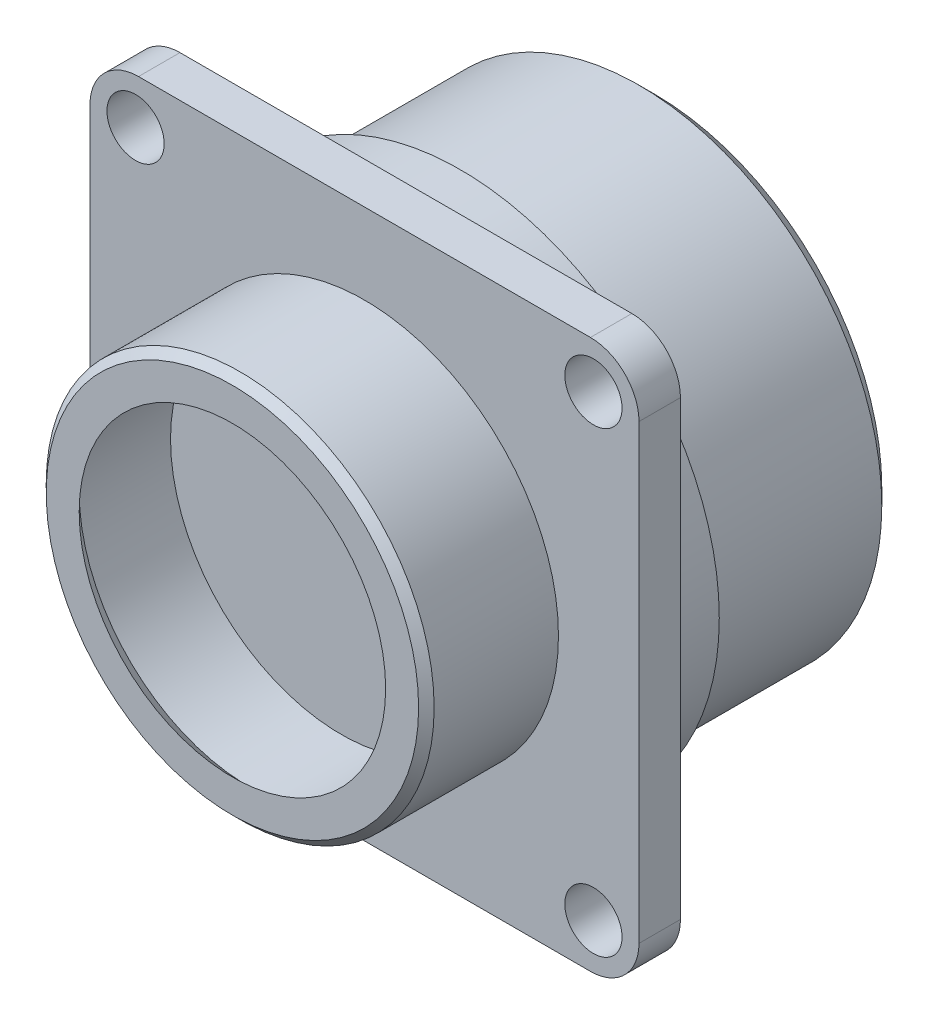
ISO-10303-21;
HEADER;
FILE_DESCRIPTION(('STEP AP214'),'2;1');
FILE_NAME('part.step','',(''),(''),'','','');
FILE_SCHEMA(('AUTOMOTIVE_DESIGN { 1 0 10303 214 1 1 1 1 }'));
ENDSEC;
DATA;
#1=APPLICATION_CONTEXT('core data for automotive mechanical design processes');
#2=APPLICATION_PROTOCOL_DEFINITION('international standard','automotive_design',2000,#1);
#3=PRODUCT_CONTEXT('',#1,'mechanical');
#4=PRODUCT('Part','Part','',(#3));
#5=PRODUCT_RELATED_PRODUCT_CATEGORY('part','',(#4));
#6=PRODUCT_DEFINITION_FORMATION('','',#4);
#7=PRODUCT_DEFINITION_CONTEXT('part definition',#1,'design');
#8=PRODUCT_DEFINITION('design','',#6,#7);
#9=PRODUCT_DEFINITION_SHAPE('','',#8);
#10=(LENGTH_UNIT() NAMED_UNIT(*) SI_UNIT(.MILLI.,.METRE.));
#11=(NAMED_UNIT(*) PLANE_ANGLE_UNIT() SI_UNIT($,.RADIAN.));
#12=(NAMED_UNIT(*) SI_UNIT($,.STERADIAN.) SOLID_ANGLE_UNIT());
#13=UNCERTAINTY_MEASURE_WITH_UNIT(LENGTH_MEASURE(1.E-05),#10,'distance_accuracy_value','');
#14=(GEOMETRIC_REPRESENTATION_CONTEXT(3) GLOBAL_UNCERTAINTY_ASSIGNED_CONTEXT((#13)) GLOBAL_UNIT_ASSIGNED_CONTEXT((#10,
#11,#12)) REPRESENTATION_CONTEXT('',''));
#15=CARTESIAN_POINT('',(0.,0.,0.));
#16=DIRECTION('',(0.,0.,1.));
#17=DIRECTION('',(1.,0.,0.));
#18=AXIS2_PLACEMENT_3D('',#15,#16,#17);
#19=CARTESIAN_POINT('',(0.,0.,22.352));
#20=DIRECTION('',(0.,0.,-1.));
#21=DIRECTION('',(-1.,0.,0.));
#22=AXIS2_PLACEMENT_3D('',#19,#20,#21);
#23=CYLINDRICAL_SURFACE('',#22,19.0246);
#24=CARTESIAN_POINT('',(0.,0.,21.59));
#25=DIRECTION('',(0.,0.,1.));
#26=DIRECTION('',(1.,0.,0.));
#27=AXIS2_PLACEMENT_3D('',#24,#25,#26);
#28=CIRCLE('',#27,19.0246);
#29=CARTESIAN_POINT('',(19.0246,0.,21.59));
#30=VERTEX_POINT('',#29);
#31=EDGE_CURVE('E11',#30,#30,#28,.F.);
#32=ORIENTED_EDGE('',*,*,#31,.T.);
#33=EDGE_LOOP('',(#32));
#34=FACE_BOUND('',#33,.T.);
#35=CARTESIAN_POINT('',(0.,0.,9.398));
#36=DIRECTION('',(0.,0.,1.));
#37=DIRECTION('',(1.,0.,0.));
#38=AXIS2_PLACEMENT_3D('',#35,#36,#37);
#39=CIRCLE('',#38,19.0246);
#40=CARTESIAN_POINT('',(19.0246,0.,9.398));
#41=VERTEX_POINT('',#40);
#42=EDGE_CURVE('E391',#41,#41,#39,.T.);
#43=ORIENTED_EDGE('',*,*,#42,.T.);
#44=EDGE_LOOP('',(#43));
#45=FACE_BOUND('',#44,.T.);
#46=ADVANCED_FACE('F381',(#34,#45),#23,.T.);
#47=CARTESIAN_POINT('',(0.,0.,22.352));
#48=DIRECTION('',(0.,0.,1.));
#49=DIRECTION('',(1.,0.,0.));
#50=AXIS2_PLACEMENT_3D('',#47,#48,#49);
#51=PLANE('',#50);
#52=CARTESIAN_POINT('',(0.,0.,22.352));
#53=DIRECTION('',(0.,0.,1.));
#54=DIRECTION('',(1.,0.,0.));
#55=AXIS2_PLACEMENT_3D('',#52,#53,#54);
#56=CIRCLE('',#55,15.0297077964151);
#57=CARTESIAN_POINT('',(15.0297077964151,0.,22.352));
#58=VERTEX_POINT('',#57);
#59=EDGE_CURVE('E398',#58,#58,#56,.T.);
#60=ORIENTED_EDGE('',*,*,#59,.F.);
#61=EDGE_LOOP('',(#60));
#62=FACE_BOUND('',#61,.T.);
#63=CARTESIAN_POINT('',(0.,0.,22.352));
#64=DIRECTION('',(0.,0.,1.));
#65=DIRECTION('',(1.,0.,0.));
#66=AXIS2_PLACEMENT_3D('',#63,#64,#65);
#67=CIRCLE('',#66,18.2626);
#68=CARTESIAN_POINT('',(18.2626,0.,22.352));
#69=VERTEX_POINT('',#68);
#70=EDGE_CURVE('E387',#69,#69,#67,.T.);
#71=ORIENTED_EDGE('',*,*,#70,.T.);
#72=EDGE_LOOP('',(#71));
#73=FACE_BOUND('',#72,.T.);
#74=ADVANCED_FACE('F425',(#62,#73),#51,.T.);
#75=CARTESIAN_POINT('',(0.,0.,9.398));
#76=DIRECTION('',(0.,0.,1.));
#77=DIRECTION('',(1.,0.,0.));
#78=AXIS2_PLACEMENT_3D('',#75,#76,#77);
#79=PLANE('',#78);
#80=ORIENTED_EDGE('',*,*,#42,.F.);
#81=EDGE_LOOP('',(#80));
#82=FACE_BOUND('',#81,.T.);
#83=ADVANCED_FACE('F431',(#82),#79,.F.);
#84=CARTESIAN_POINT('',(0.,0.,22.352));
#85=DIRECTION('',(0.,0.,-1.));
#86=DIRECTION('',(-1.,0.,0.));
#87=AXIS2_PLACEMENT_3D('',#84,#85,#86);
#88=CONICAL_SURFACE('',#87,18.2626,0.785398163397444);
#89=ORIENTED_EDGE('',*,*,#31,.F.);
#90=EDGE_LOOP('',(#89));
#91=FACE_BOUND('',#90,.T.);
#92=ORIENTED_EDGE('',*,*,#70,.F.);
#93=EDGE_LOOP('',(#92));
#94=FACE_BOUND('',#93,.T.);
#95=ADVANCED_FACE('F414',(#91,#94),#88,.T.);
#96=CARTESIAN_POINT('',(0.,0.,22.352));
#97=DIRECTION('',(0.,0.,-1.));
#98=DIRECTION('',(-1.,0.,0.));
#99=AXIS2_PLACEMENT_3D('',#96,#97,#98);
#100=CYLINDRICAL_SURFACE('',#99,16.7386);
#101=CARTESIAN_POINT('',(0.,0.,20.6431077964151));
#102=DIRECTION('',(0.,0.,-1.));
#103=DIRECTION('',(-1.,0.,0.));
#104=AXIS2_PLACEMENT_3D('',#101,#102,#103);
#105=CIRCLE('',#104,16.7386);
#106=CARTESIAN_POINT('',(-16.7386,0.,20.6431077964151));
#107=VERTEX_POINT('',#106);
#108=EDGE_CURVE('E395',#107,#107,#105,.T.);
#109=ORIENTED_EDGE('',*,*,#108,.F.);
#110=EDGE_LOOP('',(#109));
#111=FACE_BOUND('',#110,.T.);
#112=CARTESIAN_POINT('',(0.,0.,11.684));
#113=DIRECTION('',(0.,0.,1.));
#114=DIRECTION('',(1.,0.,0.));
#115=AXIS2_PLACEMENT_3D('',#112,#113,#114);
#116=CIRCLE('',#115,16.7386);
#117=CARTESIAN_POINT('',(16.7386,0.,11.684));
#118=VERTEX_POINT('',#117);
#119=EDGE_CURVE('E401',#118,#118,#116,.T.);
#120=ORIENTED_EDGE('',*,*,#119,.F.);
#121=EDGE_LOOP('',(#120));
#122=FACE_BOUND('',#121,.T.);
#123=ADVANCED_FACE('F410',(#111,#122),#100,.F.);
#124=CARTESIAN_POINT('',(0.,0.,11.684));
#125=DIRECTION('',(0.,0.,1.));
#126=DIRECTION('',(1.,0.,0.));
#127=AXIS2_PLACEMENT_3D('',#124,#125,#126);
#128=PLANE('',#127);
#129=ORIENTED_EDGE('',*,*,#119,.T.);
#130=EDGE_LOOP('',(#129));
#131=FACE_BOUND('',#130,.T.);
#132=ADVANCED_FACE('F413',(#131),#128,.T.);
#133=CARTESIAN_POINT('',(0.,0.,20.7355538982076));
#134=DIRECTION('',(0.,0.,-1.));
#135=DIRECTION('',(-1.,0.,0.));
#136=AXIS2_PLACEMENT_3D('',#133,#134,#135);
#137=CONICAL_SURFACE('',#136,16.6461538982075,0.785398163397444);
#138=ORIENTED_EDGE('',*,*,#108,.T.);
#139=EDGE_LOOP('',(#138));
#140=FACE_BOUND('',#139,.T.);
#141=ORIENTED_EDGE('',*,*,#59,.T.);
#142=EDGE_LOOP('',(#141));
#143=FACE_BOUND('',#142,.T.);
#144=ADVANCED_FACE('F407',(#140,#143),#137,.F.);
#145=CLOSED_SHELL('',(#46,#74,#83,#95,#123,#132,#144));
#146=MANIFOLD_SOLID_BREP('B2',#145);
#147=CARTESIAN_POINT('',(0.,0.,-19.05));
#148=DIRECTION('',(0.,0.,1.));
#149=DIRECTION('',(1.,0.,0.));
#150=AXIS2_PLACEMENT_3D('',#147,#148,#149);
#151=CYLINDRICAL_SURFACE('',#150,23.8125);
#152=CARTESIAN_POINT('',(0.,0.,-17.526));
#153=DIRECTION('',(0.,0.,-1.));
#154=DIRECTION('',(-1.,0.,0.));
#155=AXIS2_PLACEMENT_3D('',#152,#153,#154);
#156=CIRCLE('',#155,23.8125);
#157=CARTESIAN_POINT('',(23.8125,0.,-17.526));
#158=VERTEX_POINT('',#157);
#159=EDGE_CURVE('E380',#158,#158,#156,.F.);
#160=CARTESIAN_POINT('',(0.,0.,0.));
#161=DIRECTION('',(0.,0.,-1.));
#162=DIRECTION('',(-1.,0.,0.));
#163=AXIS2_PLACEMENT_3D('',#160,#161,#162);
#164=CIRCLE('',#163,23.8125);
#165=CARTESIAN_POINT('',(23.8125,0.,0.));
#166=VERTEX_POINT('',#165);
#167=EDGE_CURVE('E486',#166,#166,#164,.T.);
#168=CARTESIAN_POINT('',(23.8125,0.,-17.526));
#169=CARTESIAN_POINT('',(23.8125,0.,-17.3434375));
#170=CARTESIAN_POINT('',(23.8125,0.,-17.160875));
#171=CARTESIAN_POINT('',(23.8125,0.,-16.79575));
#172=CARTESIAN_POINT('',(23.8125,0.,-16.6131875));
#173=CARTESIAN_POINT('',(23.8125,0.,-16.2480625));
#174=CARTESIAN_POINT('',(23.8125,0.,-16.0655));
#175=CARTESIAN_POINT('',(23.8125,0.,-15.700375));
#176=CARTESIAN_POINT('',(23.8125,0.,-15.5178125));
#177=CARTESIAN_POINT('',(23.8125,0.,-15.1526875));
#178=CARTESIAN_POINT('',(23.8125,0.,-14.970125));
#179=CARTESIAN_POINT('',(23.8125,0.,-14.605));
#180=CARTESIAN_POINT('',(23.8125,0.,-14.4224375));
#181=CARTESIAN_POINT('',(23.8125,0.,-14.0573125));
#182=CARTESIAN_POINT('',(23.8125,0.,-13.87475));
#183=CARTESIAN_POINT('',(23.8125,0.,-13.509625));
#184=CARTESIAN_POINT('',(23.8125,0.,-13.3270625));
#185=CARTESIAN_POINT('',(23.8125,0.,-12.9619375));
#186=CARTESIAN_POINT('',(23.8125,0.,-12.779375));
#187=CARTESIAN_POINT('',(23.8125,0.,-12.41425));
#188=CARTESIAN_POINT('',(23.8125,0.,-12.2316875));
#189=CARTESIAN_POINT('',(23.8125,0.,-11.8665625));
#190=CARTESIAN_POINT('',(23.8125,0.,-11.684));
#191=CARTESIAN_POINT('',(23.8125,0.,-11.318875));
#192=CARTESIAN_POINT('',(23.8125,0.,-11.1363125));
#193=CARTESIAN_POINT('',(23.8125,0.,-10.7711875));
#194=CARTESIAN_POINT('',(23.8125,0.,-10.588625));
#195=CARTESIAN_POINT('',(23.8125,0.,-10.2235));
#196=CARTESIAN_POINT('',(23.8125,0.,-10.0409375));
#197=CARTESIAN_POINT('',(23.8125,0.,-9.6758125));
#198=CARTESIAN_POINT('',(23.8125,0.,-9.49325));
#199=CARTESIAN_POINT('',(23.8125,0.,-9.128125));
#200=CARTESIAN_POINT('',(23.8125,0.,-8.9455625));
#201=CARTESIAN_POINT('',(23.8125,0.,-8.5804375));
#202=CARTESIAN_POINT('',(23.8125,0.,-8.397875));
#203=CARTESIAN_POINT('',(23.8125,0.,-8.03275));
#204=CARTESIAN_POINT('',(23.8125,0.,-7.8501875));
#205=CARTESIAN_POINT('',(23.8125,0.,-7.4850625));
#206=CARTESIAN_POINT('',(23.8125,0.,-7.3025));
#207=CARTESIAN_POINT('',(23.8125,0.,-6.937375));
#208=CARTESIAN_POINT('',(23.8125,0.,-6.7548125));
#209=CARTESIAN_POINT('',(23.8125,0.,-6.3896875));
#210=CARTESIAN_POINT('',(23.8125,0.,-6.207125));
#211=CARTESIAN_POINT('',(23.8125,0.,-5.842));
#212=CARTESIAN_POINT('',(23.8125,0.,-5.6594375));
#213=CARTESIAN_POINT('',(23.8125,0.,-5.2943125));
#214=CARTESIAN_POINT('',(23.8125,0.,-5.11175));
#215=CARTESIAN_POINT('',(23.8125,0.,-4.746625));
#216=CARTESIAN_POINT('',(23.8125,0.,-4.5640625));
#217=CARTESIAN_POINT('',(23.8125,0.,-4.1989375));
#218=CARTESIAN_POINT('',(23.8125,0.,-4.016375));
#219=CARTESIAN_POINT('',(23.8125,0.,-3.65125));
#220=CARTESIAN_POINT('',(23.8125,0.,-3.4686875));
#221=CARTESIAN_POINT('',(23.8125,0.,-3.1035625));
#222=CARTESIAN_POINT('',(23.8125,0.,-2.921));
#223=CARTESIAN_POINT('',(23.8125,0.,-2.555875));
#224=CARTESIAN_POINT('',(23.8125,0.,-2.3733125));
#225=CARTESIAN_POINT('',(23.8125,0.,-2.0081875));
#226=CARTESIAN_POINT('',(23.8125,0.,-1.825625));
#227=CARTESIAN_POINT('',(23.8125,0.,-1.4605));
#228=CARTESIAN_POINT('',(23.8125,0.,-1.2779375));
#229=CARTESIAN_POINT('',(23.8125,0.,-0.912812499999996));
#230=CARTESIAN_POINT('',(23.8125,0.,-0.730249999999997));
#231=CARTESIAN_POINT('',(23.8125,0.,-0.365124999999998));
#232=CARTESIAN_POINT('',(23.8125,0.,-0.182562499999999));
#233=CARTESIAN_POINT('',(23.8125,0.,0.));
#234=B_SPLINE_CURVE_WITH_KNOTS('',3,(#168,#169,#170,#171,#172,#173,#174,#175,#176,#177,#178,
#179,#180,#181,#182,#183,#184,#185,#186,#187,#188,#189,#190,#191,#192,#193,#194,#195,#196,#197,
#198,#199,#200,#201,#202,#203,#204,#205,#206,#207,#208,#209,#210,#211,#212,#213,#214,#215,#216,
#217,#218,#219,#220,#221,#222,#223,#224,#225,#226,#227,#228,#229,#230,#231,#232,#233),
.UNSPECIFIED.,.F.,.F.,(4,2,2,2,2,2,2,2,2,2,2,2,2,2,2,2,2,2,2,2,2,2,2,2,2,2,2,2,2,2,2,2,4),(0.,
0.547687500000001,1.095375,1.6430625,2.19075,2.7384375,3.286125,3.8338125,4.3815,4.9291875,
5.476875,6.0245625,6.57225,7.1199375,7.667625,8.2153125,8.763,9.3106875,9.858375,10.4060625,
10.95375,11.5014375,12.049125,12.5968125,13.1445,13.6921875,14.239875,14.7875625,15.33525,
15.8829375,16.430625,16.9783125,17.526),.UNSPECIFIED.);
#235=EDGE_CURVE('BSEAM476',#158,#166,#234,.T.);
#236=ORIENTED_EDGE('',*,*,#159,.T.);
#237=ORIENTED_EDGE('',*,*,#167,.T.);
#238=ORIENTED_EDGE('',*,*,#235,.T.);
#239=ORIENTED_EDGE('',*,*,#235,.F.);
#240=EDGE_LOOP('',(#236,#238,#237,#239));
#241=FACE_BOUND('',#240,.T.);
#242=ADVANCED_FACE('F476',(#241),#151,.T.);
#243=CARTESIAN_POINT('',(0.,0.,-19.05));
#244=DIRECTION('',(0.,0.,-1.));
#245=DIRECTION('',(-1.,0.,0.));
#246=AXIS2_PLACEMENT_3D('',#243,#244,#245);
#247=PLANE('',#246);
#248=CARTESIAN_POINT('',(0.,0.,-19.05));
#249=DIRECTION('',(0.,0.,-1.));
#250=DIRECTION('',(-1.,0.,0.));
#251=AXIS2_PLACEMENT_3D('',#248,#249,#250);
#252=CIRCLE('',#251,22.2885);
#253=CARTESIAN_POINT('',(-22.2885,0.,-19.05));
#254=VERTEX_POINT('',#253);
#255=EDGE_CURVE('E482',#254,#254,#252,.T.);
#256=ORIENTED_EDGE('',*,*,#255,.T.);
#257=EDGE_LOOP('',(#256));
#258=FACE_BOUND('',#257,.T.);
#259=CARTESIAN_POINT('',(0.,0.,-19.05));
#260=DIRECTION('',(0.,0.,-1.));
#261=DIRECTION('',(-1.,0.,0.));
#262=AXIS2_PLACEMENT_3D('',#259,#260,#261);
#263=CIRCLE('',#262,21.2725);
#264=CARTESIAN_POINT('',(21.2725,0.,-19.05));
#265=VERTEX_POINT('',#264);
#266=EDGE_CURVE('E490',#265,#265,#263,.T.);
#267=ORIENTED_EDGE('',*,*,#266,.F.);
#268=EDGE_LOOP('',(#267));
#269=FACE_BOUND('',#268,.T.);
#270=ADVANCED_FACE('F512',(#258,#269),#247,.T.);
#271=CARTESIAN_POINT('',(0.,0.,0.));
#272=DIRECTION('',(0.,0.,-1.));
#273=DIRECTION('',(-1.,0.,0.));
#274=AXIS2_PLACEMENT_3D('',#271,#272,#273);
#275=PLANE('',#274);
#276=ORIENTED_EDGE('',*,*,#167,.F.);
#277=EDGE_LOOP('',(#276));
#278=FACE_BOUND('',#277,.T.);
#279=ADVANCED_FACE('F503',(#278),#275,.F.);
#280=CARTESIAN_POINT('',(0.,0.,-19.05));
#281=DIRECTION('',(0.,0.,1.));
#282=DIRECTION('',(1.,0.,0.));
#283=AXIS2_PLACEMENT_3D('',#280,#281,#282);
#284=CYLINDRICAL_SURFACE('',#283,21.2725);
#285=CARTESIAN_POINT('',(0.,0.,-2.54));
#286=DIRECTION('',(0.,0.,-1.));
#287=DIRECTION('',(-1.,0.,0.));
#288=AXIS2_PLACEMENT_3D('',#285,#286,#287);
#289=CIRCLE('',#288,21.2725);
#290=CARTESIAN_POINT('',(21.2725,0.,-2.54));
#291=VERTEX_POINT('',#290);
#292=EDGE_CURVE('E495',#291,#291,#289,.T.);
#293=CARTESIAN_POINT('',(21.2725,0.,-19.05));
#294=CARTESIAN_POINT('',(21.2725,0.,-18.8780208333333));
#295=CARTESIAN_POINT('',(21.2725,0.,-18.7060416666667));
#296=CARTESIAN_POINT('',(21.2725,0.,-18.3620833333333));
#297=CARTESIAN_POINT('',(21.2725,0.,-18.1901041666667));
#298=CARTESIAN_POINT('',(21.2725,0.,-17.8461458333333));
#299=CARTESIAN_POINT('',(21.2725,0.,-17.6741666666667));
#300=CARTESIAN_POINT('',(21.2725,0.,-17.3302083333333));
#301=CARTESIAN_POINT('',(21.2725,0.,-17.1582291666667));
#302=CARTESIAN_POINT('',(21.2725,0.,-16.8142708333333));
#303=CARTESIAN_POINT('',(21.2725,0.,-16.6422916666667));
#304=CARTESIAN_POINT('',(21.2725,0.,-16.2983333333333));
#305=CARTESIAN_POINT('',(21.2725,0.,-16.1263541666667));
#306=CARTESIAN_POINT('',(21.2725,0.,-15.7823958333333));
#307=CARTESIAN_POINT('',(21.2725,0.,-15.6104166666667));
#308=CARTESIAN_POINT('',(21.2725,0.,-15.2664583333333));
#309=CARTESIAN_POINT('',(21.2725,0.,-15.0944791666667));
#310=CARTESIAN_POINT('',(21.2725,0.,-14.7505208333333));
#311=CARTESIAN_POINT('',(21.2725,0.,-14.5785416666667));
#312=CARTESIAN_POINT('',(21.2725,0.,-14.2345833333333));
#313=CARTESIAN_POINT('',(21.2725,0.,-14.0626041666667));
#314=CARTESIAN_POINT('',(21.2725,0.,-13.7186458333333));
#315=CARTESIAN_POINT('',(21.2725,0.,-13.5466666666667));
#316=CARTESIAN_POINT('',(21.2725,0.,-13.2027083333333));
#317=CARTESIAN_POINT('',(21.2725,0.,-13.0307291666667));
#318=CARTESIAN_POINT('',(21.2725,0.,-12.6867708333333));
#319=CARTESIAN_POINT('',(21.2725,0.,-12.5147916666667));
#320=CARTESIAN_POINT('',(21.2725,0.,-12.1708333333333));
#321=CARTESIAN_POINT('',(21.2725,0.,-11.9988541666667));
#322=CARTESIAN_POINT('',(21.2725,0.,-11.6548958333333));
#323=CARTESIAN_POINT('',(21.2725,0.,-11.4829166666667));
#324=CARTESIAN_POINT('',(21.2725,0.,-11.1389583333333));
#325=CARTESIAN_POINT('',(21.2725,0.,-10.9669791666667));
#326=CARTESIAN_POINT('',(21.2725,0.,-10.6230208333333));
#327=CARTESIAN_POINT('',(21.2725,0.,-10.4510416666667));
#328=CARTESIAN_POINT('',(21.2725,0.,-10.1070833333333));
#329=CARTESIAN_POINT('',(21.2725,0.,-9.93510416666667));
#330=CARTESIAN_POINT('',(21.2725,0.,-9.59114583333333));
#331=CARTESIAN_POINT('',(21.2725,0.,-9.41916666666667));
#332=CARTESIAN_POINT('',(21.2725,0.,-9.07520833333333));
#333=CARTESIAN_POINT('',(21.2725,0.,-8.90322916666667));
#334=CARTESIAN_POINT('',(21.2725,0.,-8.55927083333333));
#335=CARTESIAN_POINT('',(21.2725,0.,-8.38729166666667));
#336=CARTESIAN_POINT('',(21.2725,0.,-8.04333333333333));
#337=CARTESIAN_POINT('',(21.2725,0.,-7.87135416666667));
#338=CARTESIAN_POINT('',(21.2725,0.,-7.52739583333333));
#339=CARTESIAN_POINT('',(21.2725,0.,-7.35541666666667));
#340=CARTESIAN_POINT('',(21.2725,0.,-7.01145833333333));
#341=CARTESIAN_POINT('',(21.2725,0.,-6.83947916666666));
#342=CARTESIAN_POINT('',(21.2725,0.,-6.49552083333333));
#343=CARTESIAN_POINT('',(21.2725,0.,-6.32354166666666));
#344=CARTESIAN_POINT('',(21.2725,0.,-5.97958333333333));
#345=CARTESIAN_POINT('',(21.2725,0.,-5.80760416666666));
#346=CARTESIAN_POINT('',(21.2725,0.,-5.46364583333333));
#347=CARTESIAN_POINT('',(21.2725,0.,-5.29166666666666));
#348=CARTESIAN_POINT('',(21.2725,0.,-4.94770833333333));
#349=CARTESIAN_POINT('',(21.2725,0.,-4.77572916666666));
#350=CARTESIAN_POINT('',(21.2725,0.,-4.43177083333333));
#351=CARTESIAN_POINT('',(21.2725,0.,-4.25979166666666));
#352=CARTESIAN_POINT('',(21.2725,0.,-3.91583333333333));
#353=CARTESIAN_POINT('',(21.2725,0.,-3.74385416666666));
#354=CARTESIAN_POINT('',(21.2725,0.,-3.39989583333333));
#355=CARTESIAN_POINT('',(21.2725,0.,-3.22791666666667));
#356=CARTESIAN_POINT('',(21.2725,0.,-2.88395833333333));
#357=CARTESIAN_POINT('',(21.2725,0.,-2.71197916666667));
#358=CARTESIAN_POINT('',(21.2725,0.,-2.54));
#359=B_SPLINE_CURVE_WITH_KNOTS('',3,(#293,#294,#295,#296,#297,#298,#299,#300,#301,#302,#303,
#304,#305,#306,#307,#308,#309,#310,#311,#312,#313,#314,#315,#316,#317,#318,#319,#320,#321,#322,
#323,#324,#325,#326,#327,#328,#329,#330,#331,#332,#333,#334,#335,#336,#337,#338,#339,#340,#341,
#342,#343,#344,#345,#346,#347,#348,#349,#350,#351,#352,#353,#354,#355,#356,#357,#358),
.UNSPECIFIED.,.F.,.F.,(4,2,2,2,2,2,2,2,2,2,2,2,2,2,2,2,2,2,2,2,2,2,2,2,2,2,2,2,2,2,2,2,4),(0.,
0.515937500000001,1.031875,1.5478125,2.06375,2.5796875,3.095625,3.6115625,4.1275,4.6434375,
5.159375,5.6753125,6.19125,6.7071875,7.223125,7.7390625,8.255,8.7709375,9.286875,9.8028125,
10.31875,10.8346875,11.350625,11.8665625,12.3825,12.8984375,13.414375,13.9303125,14.44625,
14.9621875,15.478125,15.9940625,16.51),.UNSPECIFIED.);
#360=EDGE_CURVE('BSEAM501',#265,#291,#359,.T.);
#361=ORIENTED_EDGE('',*,*,#266,.T.);
#362=ORIENTED_EDGE('',*,*,#292,.F.);
#363=ORIENTED_EDGE('',*,*,#360,.T.);
#364=ORIENTED_EDGE('',*,*,#360,.F.);
#365=EDGE_LOOP('',(#361,#363,#362,#364));
#366=FACE_BOUND('',#365,.T.);
#367=ADVANCED_FACE('F501',(#366),#284,.F.);
#368=CARTESIAN_POINT('',(0.,0.,-2.54));
#369=DIRECTION('',(0.,0.,-1.));
#370=DIRECTION('',(-1.,0.,0.));
#371=AXIS2_PLACEMENT_3D('',#368,#369,#370);
#372=PLANE('',#371);
#373=ORIENTED_EDGE('',*,*,#292,.T.);
#374=EDGE_LOOP('',(#373));
#375=FACE_BOUND('',#374,.T.);
#376=ADVANCED_FACE('F499',(#375),#372,.T.);
#377=CARTESIAN_POINT('',(0.,0.,-19.05));
#378=DIRECTION('',(0.,0.,1.));
#379=DIRECTION('',(1.,0.,0.));
#380=AXIS2_PLACEMENT_3D('',#377,#378,#379);
#381=CONICAL_SURFACE('',#380,22.2885,0.785398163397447);
#382=ORIENTED_EDGE('',*,*,#159,.F.);
#383=EDGE_LOOP('',(#382));
#384=FACE_BOUND('',#383,.T.);
#385=ORIENTED_EDGE('',*,*,#255,.F.);
#386=EDGE_LOOP('',(#385));
#387=FACE_BOUND('',#386,.T.);
#388=ADVANCED_FACE('F510',(#384,#387),#381,.T.);
#389=CLOSED_SHELL('',(#242,#270,#279,#367,#376,#388));
#390=MANIFOLD_SOLID_BREP('B6',#389);
#391=CARTESIAN_POINT('',(0.,0.,5.334));
#392=DIRECTION('',(0.,0.,-1.));
#393=DIRECTION('',(-1.,0.,0.));
#394=AXIS2_PLACEMENT_3D('',#391,#392,#393);
#395=CYLINDRICAL_SURFACE('',#394,25.4);
#396=CARTESIAN_POINT('',(0.,0.,5.334));
#397=DIRECTION('',(0.,0.,1.));
#398=DIRECTION('',(1.,0.,0.));
#399=AXIS2_PLACEMENT_3D('',#396,#397,#398);
#400=CIRCLE('',#399,25.4);
#401=CARTESIAN_POINT('',(25.4,0.,5.334));
#402=VERTEX_POINT('',#401);
#403=EDGE_CURVE('E664',#402,#402,#400,.T.);
#404=ORIENTED_EDGE('',*,*,#403,.F.);
#405=EDGE_LOOP('',(#404));
#406=FACE_BOUND('',#405,.T.);
#407=CARTESIAN_POINT('',(0.,0.,0.));
#408=DIRECTION('',(0.,0.,1.));
#409=DIRECTION('',(1.,0.,0.));
#410=AXIS2_PLACEMENT_3D('',#407,#408,#409);
#411=CIRCLE('',#410,25.4);
#412=CARTESIAN_POINT('',(25.4,0.,0.));
#413=VERTEX_POINT('',#412);
#414=EDGE_CURVE('E661',#413,#413,#411,.T.);
#415=ORIENTED_EDGE('',*,*,#414,.T.);
#416=EDGE_LOOP('',(#415));
#417=FACE_BOUND('',#416,.T.);
#418=ADVANCED_FACE('F550',(#406,#417),#395,.T.);
#419=CARTESIAN_POINT('',(0.,0.,0.));
#420=DIRECTION('',(0.,0.,1.));
#421=DIRECTION('',(1.,0.,0.));
#422=AXIS2_PLACEMENT_3D('',#419,#420,#421);
#423=PLANE('',#422);
#424=ORIENTED_EDGE('',*,*,#414,.F.);
#425=EDGE_LOOP('',(#424));
#426=FACE_BOUND('',#425,.T.);
#427=ADVANCED_FACE('F716',(#426),#423,.F.);
#428=CARTESIAN_POINT('',(-26.924,-26.924,5.334));
#429=DIRECTION('',(0.,0.,1.));
#430=DIRECTION('',(1.,0.,0.));
#431=AXIS2_PLACEMENT_3D('',#428,#429,#430);
#432=PLANE('',#431);
#433=CARTESIAN_POINT('',(22.4536,-22.4536,5.334));
#434=DIRECTION('',(0.,0.,1.));
#435=DIRECTION('',(1.,0.,0.));
#436=AXIS2_PLACEMENT_3D('',#433,#434,#435);
#437=CIRCLE('',#436,2.8067);
#438=CARTESIAN_POINT('',(25.2603,-22.4536,5.334));
#439=VERTEX_POINT('',#438);
#440=EDGE_CURVE('E813',#439,#439,#437,.T.);
#441=ORIENTED_EDGE('',*,*,#440,.T.);
#442=EDGE_LOOP('',(#441));
#443=FACE_BOUND('',#442,.T.);
#444=CARTESIAN_POINT('',(-22.4536,-22.4536,5.334));
#445=DIRECTION('',(0.,0.,1.));
#446=DIRECTION('',(1.,0.,0.));
#447=AXIS2_PLACEMENT_3D('',#444,#445,#446);
#448=CIRCLE('',#447,2.8067);
#449=CARTESIAN_POINT('',(-19.6469,-22.4536,5.334));
#450=VERTEX_POINT('',#449);
#451=EDGE_CURVE('E817',#450,#450,#448,.T.);
#452=ORIENTED_EDGE('',*,*,#451,.T.);
#453=EDGE_LOOP('',(#452));
#454=FACE_BOUND('',#453,.T.);
#455=CARTESIAN_POINT('',(22.4536,22.4536,5.334));
#456=DIRECTION('',(0.,0.,1.));
#457=DIRECTION('',(1.,0.,0.));
#458=AXIS2_PLACEMENT_3D('',#455,#456,#457);
#459=CIRCLE('',#458,2.8067);
#460=CARTESIAN_POINT('',(25.2603,22.4536,5.334));
#461=VERTEX_POINT('',#460);
#462=EDGE_CURVE('E826',#461,#461,#459,.T.);
#463=ORIENTED_EDGE('',*,*,#462,.T.);
#464=EDGE_LOOP('',(#463));
#465=FACE_BOUND('',#464,.T.);
#466=CARTESIAN_POINT('',(-22.4536,22.4536,5.334));
#467=DIRECTION('',(0.,0.,1.));
#468=DIRECTION('',(1.,0.,0.));
#469=AXIS2_PLACEMENT_3D('',#466,#467,#468);
#470=CIRCLE('',#469,2.8067);
#471=CARTESIAN_POINT('',(-19.6469,22.4536,5.334));
#472=VERTEX_POINT('',#471);
#473=EDGE_CURVE('E648',#472,#472,#470,.T.);
#474=ORIENTED_EDGE('',*,*,#473,.T.);
#475=EDGE_LOOP('',(#474));
#476=FACE_BOUND('',#475,.T.);
#477=DIRECTION('',(1.,0.,0.));
#478=VECTOR('',#477,1.);
#479=CARTESIAN_POINT('',(-26.924,-26.924,5.334));
#480=LINE('',#479,#478);
#481=CARTESIAN_POINT('',(-22.1615,-26.924,5.334));
#482=VERTEX_POINT('',#481);
#483=CARTESIAN_POINT('',(22.1615,-26.924,5.334));
#484=VERTEX_POINT('',#483);
#485=EDGE_CURVE('E632',#482,#484,#480,.T.);
#486=ORIENTED_EDGE('',*,*,#485,.F.);
#487=CARTESIAN_POINT('',(-22.1615,-22.1615,5.334));
#488=DIRECTION('',(0.,0.,1.));
#489=DIRECTION('',(1.,0.,0.));
#490=AXIS2_PLACEMENT_3D('',#487,#488,#489);
#491=CIRCLE('',#490,4.7625);
#492=CARTESIAN_POINT('',(-26.924,-22.1615,5.334));
#493=VERTEX_POINT('',#492);
#494=EDGE_CURVE('E615',#482,#493,#491,.F.);
#495=ORIENTED_EDGE('',*,*,#494,.T.);
#496=DIRECTION('',(0.,-1.,0.));
#497=VECTOR('',#496,1.);
#498=CARTESIAN_POINT('',(-26.924,26.924,5.334));
#499=LINE('',#498,#497);
#500=CARTESIAN_POINT('',(-26.924,22.1615,5.334));
#501=VERTEX_POINT('',#500);
#502=EDGE_CURVE('E643',#501,#493,#499,.T.);
#503=ORIENTED_EDGE('',*,*,#502,.F.);
#504=CARTESIAN_POINT('',(-22.1615,22.1615,5.334));
#505=DIRECTION('',(0.,0.,1.));
#506=DIRECTION('',(1.,0.,0.));
#507=AXIS2_PLACEMENT_3D('',#504,#505,#506);
#508=CIRCLE('',#507,4.7625);
#509=CARTESIAN_POINT('',(-22.1615,26.924,5.334));
#510=VERTEX_POINT('',#509);
#511=EDGE_CURVE('E636',#501,#510,#508,.F.);
#512=ORIENTED_EDGE('',*,*,#511,.T.);
#513=DIRECTION('',(-1.,0.,0.));
#514=VECTOR('',#513,1.);
#515=CARTESIAN_POINT('',(-26.924,26.924,5.334));
#516=LINE('',#515,#514);
#517=CARTESIAN_POINT('',(22.1615,26.924,5.334));
#518=VERTEX_POINT('',#517);
#519=EDGE_CURVE('E646',#518,#510,#516,.T.);
#520=ORIENTED_EDGE('',*,*,#519,.F.);
#521=CARTESIAN_POINT('',(22.1615,22.1615,5.334));
#522=DIRECTION('',(0.,0.,1.));
#523=DIRECTION('',(1.,0.,0.));
#524=AXIS2_PLACEMENT_3D('',#521,#522,#523);
#525=CIRCLE('',#524,4.7625);
#526=CARTESIAN_POINT('',(26.924,22.1615,5.334));
#527=VERTEX_POINT('',#526);
#528=EDGE_CURVE('E669',#518,#527,#525,.F.);
#529=ORIENTED_EDGE('',*,*,#528,.T.);
#530=DIRECTION('',(0.,1.,0.));
#531=VECTOR('',#530,1.);
#532=CARTESIAN_POINT('',(26.924,26.924,5.334));
#533=LINE('',#532,#531);
#534=CARTESIAN_POINT('',(26.924,-22.1615,5.334));
#535=VERTEX_POINT('',#534);
#536=EDGE_CURVE('E642',#535,#527,#533,.T.);
#537=ORIENTED_EDGE('',*,*,#536,.F.);
#538=CARTESIAN_POINT('',(22.1615,-22.1615,5.334));
#539=DIRECTION('',(0.,0.,1.));
#540=DIRECTION('',(1.,0.,0.));
#541=AXIS2_PLACEMENT_3D('',#538,#539,#540);
#542=CIRCLE('',#541,4.7625);
#543=EDGE_CURVE('E626',#535,#484,#542,.F.);
#544=ORIENTED_EDGE('',*,*,#543,.T.);
#545=EDGE_LOOP('',(#486,#495,#503,#512,#520,#529,#537,#544));
#546=FACE_BOUND('',#545,.T.);
#547=ORIENTED_EDGE('',*,*,#403,.T.);
#548=EDGE_LOOP('',(#547));
#549=FACE_BOUND('',#548,.T.);
#550=ADVANCED_FACE('F639',(#443,#454,#465,#476,#546,#549),#432,.F.);
#551=CARTESIAN_POINT('',(-26.924,26.924,9.398));
#552=DIRECTION('',(1.,0.,0.));
#553=DIRECTION('',(0.,1.,0.));
#554=AXIS2_PLACEMENT_3D('',#551,#552,#553);
#555=PLANE('',#554);
#556=ORIENTED_EDGE('',*,*,#502,.T.);
#557=DIRECTION('',(0.,0.,-1.));
#558=VECTOR('',#557,1.);
#559=CARTESIAN_POINT('',(-26.924,-22.1615,9.398));
#560=LINE('',#559,#558);
#561=CARTESIAN_POINT('',(-26.924,-22.1615,9.398));
#562=VERTEX_POINT('',#561);
#563=EDGE_CURVE('E620',#493,#562,#560,.F.);
#564=ORIENTED_EDGE('',*,*,#563,.T.);
#565=DIRECTION('',(0.,-1.,0.));
#566=VECTOR('',#565,1.);
#567=CARTESIAN_POINT('',(-26.924,26.924,9.398));
#568=LINE('',#567,#566);
#569=CARTESIAN_POINT('',(-26.924,22.1615,9.398));
#570=VERTEX_POINT('',#569);
#571=EDGE_CURVE('E653',#570,#562,#568,.T.);
#572=ORIENTED_EDGE('',*,*,#571,.F.);
#573=DIRECTION('',(0.,0.,-1.));
#574=VECTOR('',#573,1.);
#575=CARTESIAN_POINT('',(-26.924,22.1615,9.398));
#576=LINE('',#575,#574);
#577=EDGE_CURVE('E625',#570,#501,#576,.T.);
#578=ORIENTED_EDGE('',*,*,#577,.T.);
#579=EDGE_LOOP('',(#556,#564,#572,#578));
#580=FACE_BOUND('',#579,.T.);
#581=ADVANCED_FACE('F705',(#580),#555,.F.);
#582=CARTESIAN_POINT('',(-26.924,-26.924,9.398));
#583=DIRECTION('',(0.,1.,0.));
#584=DIRECTION('',(0.,0.,1.));
#585=AXIS2_PLACEMENT_3D('',#582,#583,#584);
#586=PLANE('',#585);
#587=DIRECTION('',(1.,0.,0.));
#588=VECTOR('',#587,1.);
#589=CARTESIAN_POINT('',(-26.924,-26.924,9.398));
#590=LINE('',#589,#588);
#591=CARTESIAN_POINT('',(-22.1615,-26.924,9.398));
#592=VERTEX_POINT('',#591);
#593=CARTESIAN_POINT('',(22.1615,-26.924,9.398));
#594=VERTEX_POINT('',#593);
#595=EDGE_CURVE('E635',#592,#594,#590,.T.);
#596=ORIENTED_EDGE('',*,*,#595,.F.);
#597=DIRECTION('',(0.,0.,-1.));
#598=VECTOR('',#597,1.);
#599=CARTESIAN_POINT('',(-22.1615,-26.924,9.398));
#600=LINE('',#599,#598);
#601=EDGE_CURVE('E619',#592,#482,#600,.T.);
#602=ORIENTED_EDGE('',*,*,#601,.T.);
#603=ORIENTED_EDGE('',*,*,#485,.T.);
#604=DIRECTION('',(0.,0.,-1.));
#605=VECTOR('',#604,1.);
#606=CARTESIAN_POINT('',(22.1615,-26.924,9.398));
#607=LINE('',#606,#605);
#608=EDGE_CURVE('E637',#484,#594,#607,.F.);
#609=ORIENTED_EDGE('',*,*,#608,.T.);
#610=EDGE_LOOP('',(#596,#602,#603,#609));
#611=FACE_BOUND('',#610,.T.);
#612=ADVANCED_FACE('F631',(#611),#586,.F.);
#613=CARTESIAN_POINT('',(26.924,26.924,9.398));
#614=DIRECTION('',(-1.,0.,0.));
#615=DIRECTION('',(0.,-1.,0.));
#616=AXIS2_PLACEMENT_3D('',#613,#614,#615);
#617=PLANE('',#616);
#618=DIRECTION('',(0.,1.,0.));
#619=VECTOR('',#618,1.);
#620=CARTESIAN_POINT('',(26.924,26.924,9.398));
#621=LINE('',#620,#619);
#622=CARTESIAN_POINT('',(26.924,-22.1615,9.398));
#623=VERTEX_POINT('',#622);
#624=CARTESIAN_POINT('',(26.924,22.1615,9.398));
#625=VERTEX_POINT('',#624);
#626=EDGE_CURVE('E657',#623,#625,#621,.T.);
#627=ORIENTED_EDGE('',*,*,#626,.F.);
#628=DIRECTION('',(0.,0.,-1.));
#629=VECTOR('',#628,1.);
#630=CARTESIAN_POINT('',(26.924,-22.1615,9.398));
#631=LINE('',#630,#629);
#632=EDGE_CURVE('E684',#623,#535,#631,.T.);
#633=ORIENTED_EDGE('',*,*,#632,.T.);
#634=ORIENTED_EDGE('',*,*,#536,.T.);
#635=DIRECTION('',(0.,0.,-1.));
#636=VECTOR('',#635,1.);
#637=CARTESIAN_POINT('',(26.924,22.1615,9.398));
#638=LINE('',#637,#636);
#639=EDGE_CURVE('E682',#527,#625,#638,.F.);
#640=ORIENTED_EDGE('',*,*,#639,.T.);
#641=EDGE_LOOP('',(#627,#633,#634,#640));
#642=FACE_BOUND('',#641,.T.);
#643=ADVANCED_FACE('F689',(#642),#617,.F.);
#644=CARTESIAN_POINT('',(-26.924,26.924,9.398));
#645=DIRECTION('',(0.,-1.,0.));
#646=DIRECTION('',(0.,0.,-1.));
#647=AXIS2_PLACEMENT_3D('',#644,#645,#646);
#648=PLANE('',#647);
#649=DIRECTION('',(-1.,0.,0.));
#650=VECTOR('',#649,1.);
#651=CARTESIAN_POINT('',(-26.924,26.924,9.398));
#652=LINE('',#651,#650);
#653=CARTESIAN_POINT('',(22.1615,26.924,9.398));
#654=VERTEX_POINT('',#653);
#655=CARTESIAN_POINT('',(-22.1615,26.924,9.398));
#656=VERTEX_POINT('',#655);
#657=EDGE_CURVE('E659',#654,#656,#652,.T.);
#658=ORIENTED_EDGE('',*,*,#657,.F.);
#659=DIRECTION('',(0.,0.,-1.));
#660=VECTOR('',#659,1.);
#661=CARTESIAN_POINT('',(22.1615,26.924,9.398));
#662=LINE('',#661,#660);
#663=EDGE_CURVE('E474',#654,#518,#662,.T.);
#664=ORIENTED_EDGE('',*,*,#663,.T.);
#665=ORIENTED_EDGE('',*,*,#519,.T.);
#666=DIRECTION('',(0.,0.,-1.));
#667=VECTOR('',#666,1.);
#668=CARTESIAN_POINT('',(-22.1615,26.924,9.398));
#669=LINE('',#668,#667);
#670=EDGE_CURVE('E557',#510,#656,#669,.F.);
#671=ORIENTED_EDGE('',*,*,#670,.T.);
#672=EDGE_LOOP('',(#658,#664,#665,#671));
#673=FACE_BOUND('',#672,.T.);
#674=ADVANCED_FACE('F697',(#673),#648,.F.);
#675=CARTESIAN_POINT('',(-26.924,-26.924,9.398));
#676=DIRECTION('',(0.,0.,1.));
#677=DIRECTION('',(1.,0.,0.));
#678=AXIS2_PLACEMENT_3D('',#675,#676,#677);
#679=PLANE('',#678);
#680=CARTESIAN_POINT('',(22.4536,-22.4536,9.398));
#681=DIRECTION('',(0.,0.,1.));
#682=DIRECTION('',(1.,0.,0.));
#683=AXIS2_PLACEMENT_3D('',#680,#681,#682);
#684=CIRCLE('',#683,2.8067);
#685=CARTESIAN_POINT('',(25.2603,-22.4536,9.398));
#686=VERTEX_POINT('',#685);
#687=EDGE_CURVE('E811',#686,#686,#684,.T.);
#688=ORIENTED_EDGE('',*,*,#687,.F.);
#689=EDGE_LOOP('',(#688));
#690=FACE_BOUND('',#689,.T.);
#691=CARTESIAN_POINT('',(-22.4536,-22.4536,9.398));
#692=DIRECTION('',(0.,0.,1.));
#693=DIRECTION('',(1.,0.,0.));
#694=AXIS2_PLACEMENT_3D('',#691,#692,#693);
#695=CIRCLE('',#694,2.8067);
#696=CARTESIAN_POINT('',(-19.6469,-22.4536,9.398));
#697=VERTEX_POINT('',#696);
#698=EDGE_CURVE('E814',#697,#697,#695,.T.);
#699=ORIENTED_EDGE('',*,*,#698,.F.);
#700=EDGE_LOOP('',(#699));
#701=FACE_BOUND('',#700,.T.);
#702=CARTESIAN_POINT('',(22.4536,22.4536,9.398));
#703=DIRECTION('',(0.,0.,1.));
#704=DIRECTION('',(1.,0.,0.));
#705=AXIS2_PLACEMENT_3D('',#702,#703,#704);
#706=CIRCLE('',#705,2.8067);
#707=CARTESIAN_POINT('',(25.2603,22.4536,9.398));
#708=VERTEX_POINT('',#707);
#709=EDGE_CURVE('E823',#708,#708,#706,.T.);
#710=ORIENTED_EDGE('',*,*,#709,.F.);
#711=EDGE_LOOP('',(#710));
#712=FACE_BOUND('',#711,.T.);
#713=CARTESIAN_POINT('',(-22.4536,22.4536,9.398));
#714=DIRECTION('',(0.,0.,1.));
#715=DIRECTION('',(1.,0.,0.));
#716=AXIS2_PLACEMENT_3D('',#713,#714,#715);
#717=CIRCLE('',#716,2.8067);
#718=CARTESIAN_POINT('',(-19.6469,22.4536,9.398));
#719=VERTEX_POINT('',#718);
#720=EDGE_CURVE('E829',#719,#719,#717,.T.);
#721=ORIENTED_EDGE('',*,*,#720,.F.);
#722=EDGE_LOOP('',(#721));
#723=FACE_BOUND('',#722,.T.);
#724=ORIENTED_EDGE('',*,*,#571,.T.);
#725=CARTESIAN_POINT('',(-22.1615,-22.1615,9.398));
#726=DIRECTION('',(0.,0.,1.));
#727=DIRECTION('',(1.,0.,0.));
#728=AXIS2_PLACEMENT_3D('',#725,#726,#727);
#729=CIRCLE('',#728,4.7625);
#730=EDGE_CURVE('E680',#562,#592,#729,.T.);
#731=ORIENTED_EDGE('',*,*,#730,.T.);
#732=ORIENTED_EDGE('',*,*,#595,.T.);
#733=CARTESIAN_POINT('',(22.1615,-22.1615,9.398));
#734=DIRECTION('',(0.,0.,1.));
#735=DIRECTION('',(1.,0.,0.));
#736=AXIS2_PLACEMENT_3D('',#733,#734,#735);
#737=CIRCLE('',#736,4.7625);
#738=EDGE_CURVE('E678',#594,#623,#737,.T.);
#739=ORIENTED_EDGE('',*,*,#738,.T.);
#740=ORIENTED_EDGE('',*,*,#626,.T.);
#741=CARTESIAN_POINT('',(22.1615,22.1615,9.398));
#742=DIRECTION('',(0.,0.,1.));
#743=DIRECTION('',(1.,0.,0.));
#744=AXIS2_PLACEMENT_3D('',#741,#742,#743);
#745=CIRCLE('',#744,4.7625);
#746=EDGE_CURVE('E570',#625,#654,#745,.T.);
#747=ORIENTED_EDGE('',*,*,#746,.T.);
#748=ORIENTED_EDGE('',*,*,#657,.T.);
#749=CARTESIAN_POINT('',(-22.1615,22.1615,9.398));
#750=DIRECTION('',(0.,0.,1.));
#751=DIRECTION('',(1.,0.,0.));
#752=AXIS2_PLACEMENT_3D('',#749,#750,#751);
#753=CIRCLE('',#752,4.7625);
#754=EDGE_CURVE('E675',#656,#570,#753,.T.);
#755=ORIENTED_EDGE('',*,*,#754,.T.);
#756=EDGE_LOOP('',(#724,#731,#732,#739,#740,#747,#748,#755));
#757=FACE_BOUND('',#756,.T.);
#758=ADVANCED_FACE('F699',(#690,#701,#712,#723,#757),#679,.T.);
#759=CARTESIAN_POINT('',(-22.1615,-22.1615,9.398));
#760=DIRECTION('',(0.,0.,-1.));
#761=DIRECTION('',(-1.,0.,0.));
#762=AXIS2_PLACEMENT_3D('',#759,#760,#761);
#763=CYLINDRICAL_SURFACE('',#762,4.7625);
#764=ORIENTED_EDGE('',*,*,#730,.F.);
#765=ORIENTED_EDGE('',*,*,#563,.F.);
#766=ORIENTED_EDGE('',*,*,#494,.F.);
#767=ORIENTED_EDGE('',*,*,#601,.F.);
#768=EDGE_LOOP('',(#764,#765,#766,#767));
#769=FACE_BOUND('',#768,.T.);
#770=ADVANCED_FACE('F618',(#769),#763,.T.);
#771=CARTESIAN_POINT('',(22.1615,-22.1615,9.398));
#772=DIRECTION('',(0.,0.,-1.));
#773=DIRECTION('',(-1.,0.,0.));
#774=AXIS2_PLACEMENT_3D('',#771,#772,#773);
#775=CYLINDRICAL_SURFACE('',#774,4.7625);
#776=ORIENTED_EDGE('',*,*,#738,.F.);
#777=ORIENTED_EDGE('',*,*,#608,.F.);
#778=ORIENTED_EDGE('',*,*,#543,.F.);
#779=ORIENTED_EDGE('',*,*,#632,.F.);
#780=EDGE_LOOP('',(#776,#777,#778,#779));
#781=FACE_BOUND('',#780,.T.);
#782=ADVANCED_FACE('F706',(#781),#775,.T.);
#783=CARTESIAN_POINT('',(22.1615,22.1615,9.398));
#784=DIRECTION('',(0.,0.,-1.));
#785=DIRECTION('',(-1.,0.,0.));
#786=AXIS2_PLACEMENT_3D('',#783,#784,#785);
#787=CYLINDRICAL_SURFACE('',#786,4.7625);
#788=ORIENTED_EDGE('',*,*,#746,.F.);
#789=ORIENTED_EDGE('',*,*,#639,.F.);
#790=ORIENTED_EDGE('',*,*,#528,.F.);
#791=ORIENTED_EDGE('',*,*,#663,.F.);
#792=EDGE_LOOP('',(#788,#789,#790,#791));
#793=FACE_BOUND('',#792,.T.);
#794=ADVANCED_FACE('F696',(#793),#787,.T.);
#795=CARTESIAN_POINT('',(-22.1615,22.1615,9.398));
#796=DIRECTION('',(0.,0.,-1.));
#797=DIRECTION('',(-1.,0.,0.));
#798=AXIS2_PLACEMENT_3D('',#795,#796,#797);
#799=CYLINDRICAL_SURFACE('',#798,4.7625);
#800=ORIENTED_EDGE('',*,*,#754,.F.);
#801=ORIENTED_EDGE('',*,*,#670,.F.);
#802=ORIENTED_EDGE('',*,*,#511,.F.);
#803=ORIENTED_EDGE('',*,*,#577,.F.);
#804=EDGE_LOOP('',(#800,#801,#802,#803));
#805=FACE_BOUND('',#804,.T.);
#806=ADVANCED_FACE('F703',(#805),#799,.T.);
#807=CARTESIAN_POINT('',(-22.4536,22.4536,9.398));
#808=DIRECTION('',(0.,0.,1.));
#809=DIRECTION('',(1.,0.,0.));
#810=AXIS2_PLACEMENT_3D('',#807,#808,#809);
#811=CYLINDRICAL_SURFACE('',#810,2.8067);
#812=ORIENTED_EDGE('',*,*,#720,.T.);
#813=EDGE_LOOP('',(#812));
#814=FACE_BOUND('',#813,.T.);
#815=ORIENTED_EDGE('',*,*,#473,.F.);
#816=EDGE_LOOP('',(#815));
#817=FACE_BOUND('',#816,.T.);
#818=ADVANCED_FACE('F776',(#814,#817),#811,.F.);
#819=CARTESIAN_POINT('',(22.4536,22.4536,9.398));
#820=DIRECTION('',(0.,0.,1.));
#821=DIRECTION('',(1.,0.,0.));
#822=AXIS2_PLACEMENT_3D('',#819,#820,#821);
#823=CYLINDRICAL_SURFACE('',#822,2.8067);
#824=ORIENTED_EDGE('',*,*,#709,.T.);
#825=EDGE_LOOP('',(#824));
#826=FACE_BOUND('',#825,.T.);
#827=ORIENTED_EDGE('',*,*,#462,.F.);
#828=EDGE_LOOP('',(#827));
#829=FACE_BOUND('',#828,.T.);
#830=ADVANCED_FACE('F783',(#826,#829),#823,.F.);
#831=CARTESIAN_POINT('',(-22.4536,-22.4536,9.398));
#832=DIRECTION('',(0.,0.,1.));
#833=DIRECTION('',(1.,0.,0.));
#834=AXIS2_PLACEMENT_3D('',#831,#832,#833);
#835=CYLINDRICAL_SURFACE('',#834,2.8067);
#836=ORIENTED_EDGE('',*,*,#698,.T.);
#837=EDGE_LOOP('',(#836));
#838=FACE_BOUND('',#837,.T.);
#839=ORIENTED_EDGE('',*,*,#451,.F.);
#840=EDGE_LOOP('',(#839));
#841=FACE_BOUND('',#840,.T.);
#842=ADVANCED_FACE('F790',(#838,#841),#835,.F.);
#843=CARTESIAN_POINT('',(22.4536,-22.4536,9.398));
#844=DIRECTION('',(0.,0.,1.));
#845=DIRECTION('',(1.,0.,0.));
#846=AXIS2_PLACEMENT_3D('',#843,#844,#845);
#847=CYLINDRICAL_SURFACE('',#846,2.8067);
#848=ORIENTED_EDGE('',*,*,#687,.T.);
#849=EDGE_LOOP('',(#848));
#850=FACE_BOUND('',#849,.T.);
#851=ORIENTED_EDGE('',*,*,#440,.F.);
#852=EDGE_LOOP('',(#851));
#853=FACE_BOUND('',#852,.T.);
#854=ADVANCED_FACE('F798',(#850,#853),#847,.F.);
#855=CLOSED_SHELL('',(#418,#427,#550,#581,#612,#643,#674,#758,#770,#782,#794,#806,#818,#830,
#842,#854));
#856=MANIFOLD_SOLID_BREP('B375',#855);
#857=ADVANCED_BREP_SHAPE_REPRESENTATION('',(#18,#146,#390,#856),#14);
#858=SHAPE_DEFINITION_REPRESENTATION(#9,#857);
ENDSEC;
END-ISO-10303-21;
